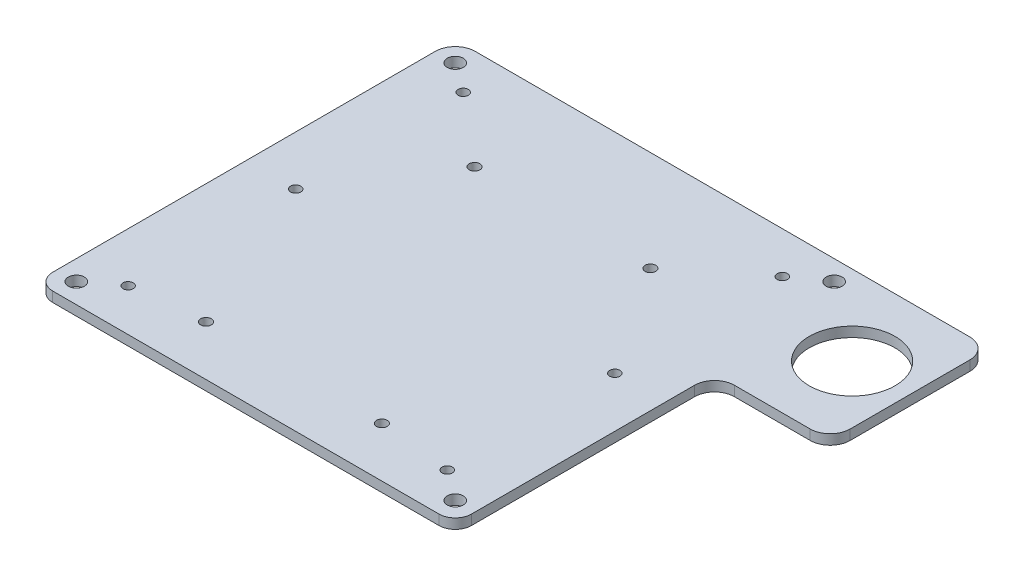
from build123d import *

# Parameters (mm, degrees)
BOSS_EXTRUDE1_DEPTH    = 3.175
M3_CLEARANCE_HOLE1_D   = 3.4
F_10_CLEARANCE_HOLE1_D = 5.1054
F_4_CLEARANCE_HOLE1_D  = 3.2639
SKETCH8_R              = 13.6525
CUT_EXTRUDE1_DEPTH     = 124.162174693


with BuildPart() as part:
    # Sketch1 → Boss-Extrude1 (new body)
    with BuildSketch(Plane(origin=(0, 0, 0), x_dir=(1, 0, 0), z_dir=(0, 1, 0))):
        with BuildLine():
            Line((-60.325, 66.675), (97.155, 66.675))
            ThreePointArc((97.155, 66.675), (101.645128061, 64.815128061), (103.505, 60.325))
            Line((103.505, 60.325), (103.505, 22.225))
            ThreePointArc((103.505, 22.225), (101.645128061, 17.734871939), (97.155, 15.875))
            Line((97.155, 15.875), (73.025, 15.875))
            ThreePointArc((73.025, 15.875), (68.534871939, 14.015128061), (66.675, 9.525))
            Line((66.675, 9.525), (66.675, -61.49381957))
            ThreePointArc((66.675, -61.49381957), (65.157467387, -65.157467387), (61.49381957, -66.675))
            Line((61.49381957, -66.675), (-61.49381957, -66.675))
            ThreePointArc((-61.49381957, -66.675), (-65.157467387, -65.157467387), (-66.675, -61.49381957))
            Line((-66.675, -61.49381957), (-66.675, 60.325))
            ThreePointArc((-66.675, 60.325), (-64.815128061, 64.815128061), (-60.325, 66.675))
        make_face()
    extrude(amount=BOSS_EXTRUDE1_DEPTH)

    # M3 Clearance Hole1 (through all)
    with Locations(Plane(origin=(0, 0, 0), x_dir=(-1, 0, 0), z_dir=(0, -1, 0))):
        with Locations((28.5897, 34.73479995), (-27.4103, 34.73479995), (28.5897, -50.76520005), (-27.4103, -50.76520005)):
            Hole(M3_CLEARANCE_HOLE1_D / 2)

    # 10 Clearance Hole1 (through all)
    with Locations(Plane(origin=(0, 3.175, 0), x_dir=(1, 0, 0), z_dir=(0, 1, 0))):
        with Locations((-60.325, 60.325), (60.325, 60.325), (60.325, -60.325), (-60.325, -60.325)):
            Hole(F_10_CLEARANCE_HOLE1_D / 2)

    # 4 Clearance Hole1 (through all)
    with Locations(Plane(origin=(0, 0, 0), x_dir=(-1, 0, 0), z_dir=(0, -1, 0))):
        with Locations((50.927, -53.213), (-50.673, -53.213), (-50.673, 53.467), (50.927, 53.467), (50.927, 0.127), (-50.673, 0.127)):
            Hole(F_4_CLEARANCE_HOLE1_D / 2)

    # Sketch8 → Cut-Extrude1 (cut, through all)
    with BuildSketch(Plane(origin=(0, 3.175, 0), x_dir=(1, 0, 0), z_dir=(0, 1, 0))):
        with Locations(Location((85.09, 41.275, 0), (0, 0, 270))):
            Circle(SKETCH8_R)
    extrude(amount=-CUT_EXTRUDE1_DEPTH, mode=Mode.SUBTRACT)


solid = part.part
